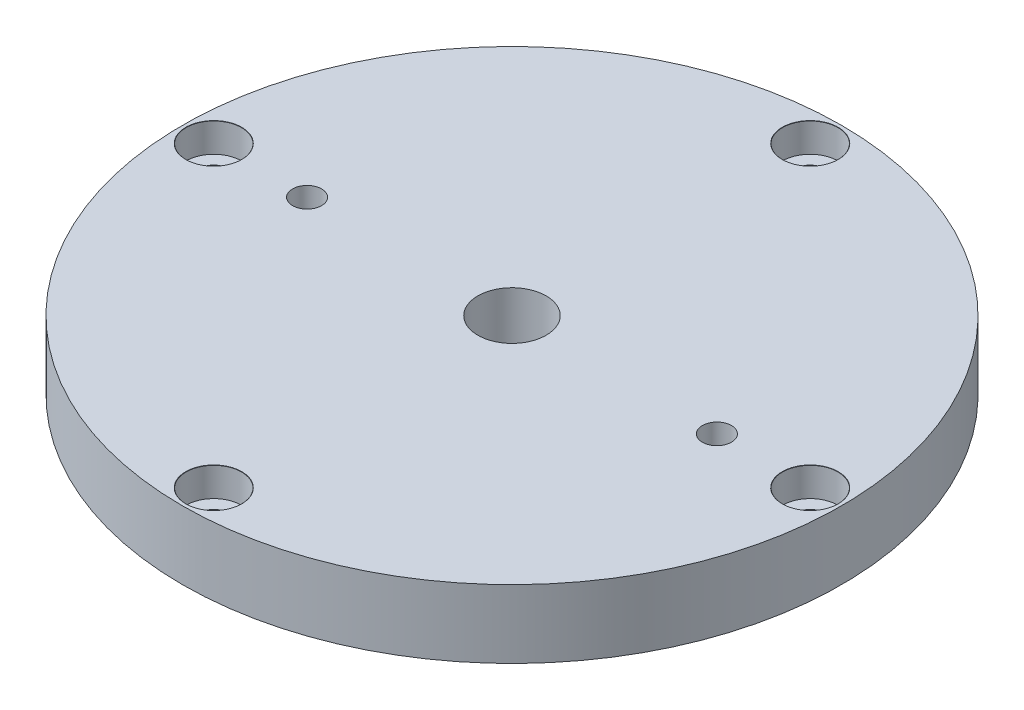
ISO-10303-21;
HEADER;
FILE_DESCRIPTION(('STEP AP214'),'2;1');
FILE_NAME('part.step','',(''),(''),'','','');
FILE_SCHEMA(('AUTOMOTIVE_DESIGN { 1 0 10303 214 1 1 1 1 }'));
ENDSEC;
DATA;
#1=APPLICATION_CONTEXT('core data for automotive mechanical design processes');
#2=APPLICATION_PROTOCOL_DEFINITION('international standard','automotive_design',2000,#1);
#3=PRODUCT_CONTEXT('',#1,'mechanical');
#4=PRODUCT('Part','Part','',(#3));
#5=PRODUCT_RELATED_PRODUCT_CATEGORY('part','',(#4));
#6=PRODUCT_DEFINITION_FORMATION('','',#4);
#7=PRODUCT_DEFINITION_CONTEXT('part definition',#1,'design');
#8=PRODUCT_DEFINITION('design','',#6,#7);
#9=PRODUCT_DEFINITION_SHAPE('','',#8);
#10=(LENGTH_UNIT() NAMED_UNIT(*) SI_UNIT(.MILLI.,.METRE.));
#11=(NAMED_UNIT(*) PLANE_ANGLE_UNIT() SI_UNIT($,.RADIAN.));
#12=(NAMED_UNIT(*) SI_UNIT($,.STERADIAN.) SOLID_ANGLE_UNIT());
#13=UNCERTAINTY_MEASURE_WITH_UNIT(LENGTH_MEASURE(1.E-05),#10,'distance_accuracy_value','');
#14=(GEOMETRIC_REPRESENTATION_CONTEXT(3) GLOBAL_UNCERTAINTY_ASSIGNED_CONTEXT((#13)) GLOBAL_UNIT_ASSIGNED_CONTEXT((#10,
#11,#12)) REPRESENTATION_CONTEXT('',''));
#15=CARTESIAN_POINT('',(0.,0.,0.));
#16=DIRECTION('',(0.,0.,1.));
#17=DIRECTION('',(1.,0.,0.));
#18=AXIS2_PLACEMENT_3D('',#15,#16,#17);
#19=CARTESIAN_POINT('',(0.,4.,0.));
#20=DIRECTION('',(0.,-1.,0.));
#21=DIRECTION('',(0.,0.,-1.));
#22=AXIS2_PLACEMENT_3D('',#19,#20,#21);
#23=CYLINDRICAL_SURFACE('',#22,38.6);
#24=CARTESIAN_POINT('',(0.,4.,0.));
#25=DIRECTION('',(0.,1.,0.));
#26=DIRECTION('',(0.,0.,1.));
#27=AXIS2_PLACEMENT_3D('',#24,#25,#26);
#28=CIRCLE('',#27,38.6);
#29=CARTESIAN_POINT('',(0.,4.,38.6));
#30=VERTEX_POINT('',#29);
#31=EDGE_CURVE('E11',#30,#30,#28,.T.);
#32=ORIENTED_EDGE('',*,*,#31,.F.);
#33=EDGE_LOOP('',(#32));
#34=FACE_BOUND('',#33,.T.);
#35=CARTESIAN_POINT('',(0.,-4.,0.));
#36=DIRECTION('',(0.,1.,0.));
#37=DIRECTION('',(0.,0.,1.));
#38=AXIS2_PLACEMENT_3D('',#35,#36,#37);
#39=CIRCLE('',#38,38.6);
#40=CARTESIAN_POINT('',(0.,-4.,38.6));
#41=VERTEX_POINT('',#40);
#42=EDGE_CURVE('E42',#41,#41,#39,.T.);
#43=ORIENTED_EDGE('',*,*,#42,.T.);
#44=EDGE_LOOP('',(#43));
#45=FACE_BOUND('',#44,.T.);
#46=ADVANCED_FACE('F39',(#34,#45),#23,.T.);
#47=CARTESIAN_POINT('',(0.,4.,0.));
#48=DIRECTION('',(0.,1.,0.));
#49=DIRECTION('',(0.,0.,1.));
#50=AXIS2_PLACEMENT_3D('',#47,#48,#49);
#51=PLANE('',#50);
#52=CARTESIAN_POINT('',(0.,4.,0.));
#53=DIRECTION('',(0.,-1.,0.));
#54=DIRECTION('',(0.,0.,-1.));
#55=AXIS2_PLACEMENT_3D('',#52,#53,#54);
#56=CIRCLE('',#55,4.);
#57=CARTESIAN_POINT('',(0.,4.,-4.));
#58=VERTEX_POINT('',#57);
#59=EDGE_CURVE('E202',#58,#58,#56,.T.);
#60=ORIENTED_EDGE('',*,*,#59,.T.);
#61=EDGE_LOOP('',(#60));
#62=FACE_BOUND('',#61,.T.);
#63=CARTESIAN_POINT('',(-24.,4.,0.));
#64=DIRECTION('',(0.,-1.,0.));
#65=DIRECTION('',(0.,0.,-1.));
#66=AXIS2_PLACEMENT_3D('',#63,#64,#65);
#67=CIRCLE('',#66,1.7);
#68=CARTESIAN_POINT('',(-24.,4.,-1.7));
#69=VERTEX_POINT('',#68);
#70=EDGE_CURVE('E208',#69,#69,#67,.T.);
#71=ORIENTED_EDGE('',*,*,#70,.T.);
#72=EDGE_LOOP('',(#71));
#73=FACE_BOUND('',#72,.T.);
#74=CARTESIAN_POINT('',(24.,4.,0.));
#75=DIRECTION('',(0.,-1.,0.));
#76=DIRECTION('',(0.,0.,1.));
#77=AXIS2_PLACEMENT_3D('',#74,#75,#76);
#78=CIRCLE('',#77,1.7);
#79=CARTESIAN_POINT('',(24.,4.,1.7));
#80=VERTEX_POINT('',#79);
#81=EDGE_CURVE('E205',#80,#80,#78,.T.);
#82=ORIENTED_EDGE('',*,*,#81,.T.);
#83=EDGE_LOOP('',(#82));
#84=FACE_BOUND('',#83,.T.);
#85=CARTESIAN_POINT('',(0.,4.,-34.93));
#86=DIRECTION('',(0.,1.,0.));
#87=DIRECTION('',(0.,0.,1.));
#88=AXIS2_PLACEMENT_3D('',#85,#86,#87);
#89=CIRCLE('',#88,3.275);
#90=CARTESIAN_POINT('',(0.,4.,-31.655));
#91=VERTEX_POINT('',#90);
#92=EDGE_CURVE('E211',#91,#91,#89,.T.);
#93=ORIENTED_EDGE('',*,*,#92,.F.);
#94=EDGE_LOOP('',(#93));
#95=FACE_BOUND('',#94,.T.);
#96=CARTESIAN_POINT('',(0.,4.,34.93));
#97=DIRECTION('',(0.,1.,0.));
#98=DIRECTION('',(0.,0.,1.));
#99=AXIS2_PLACEMENT_3D('',#96,#97,#98);
#100=CIRCLE('',#99,3.275);
#101=CARTESIAN_POINT('',(0.,4.,38.205));
#102=VERTEX_POINT('',#101);
#103=EDGE_CURVE('E234',#102,#102,#100,.T.);
#104=ORIENTED_EDGE('',*,*,#103,.F.);
#105=EDGE_LOOP('',(#104));
#106=FACE_BOUND('',#105,.T.);
#107=CARTESIAN_POINT('',(34.93,4.,0.));
#108=DIRECTION('',(0.,1.,0.));
#109=DIRECTION('',(0.,0.,1.));
#110=AXIS2_PLACEMENT_3D('',#107,#108,#109);
#111=CIRCLE('',#110,3.275);
#112=CARTESIAN_POINT('',(34.93,4.,3.275));
#113=VERTEX_POINT('',#112);
#114=EDGE_CURVE('E249',#113,#113,#111,.T.);
#115=ORIENTED_EDGE('',*,*,#114,.F.);
#116=EDGE_LOOP('',(#115));
#117=FACE_BOUND('',#116,.T.);
#118=CARTESIAN_POINT('',(-34.93,4.,0.));
#119=DIRECTION('',(0.,1.,0.));
#120=DIRECTION('',(0.,0.,1.));
#121=AXIS2_PLACEMENT_3D('',#118,#119,#120);
#122=CIRCLE('',#121,3.275);
#123=CARTESIAN_POINT('',(-34.93,4.,3.275));
#124=VERTEX_POINT('',#123);
#125=EDGE_CURVE('E264',#124,#124,#122,.T.);
#126=ORIENTED_EDGE('',*,*,#125,.F.);
#127=EDGE_LOOP('',(#126));
#128=FACE_BOUND('',#127,.T.);
#129=ORIENTED_EDGE('',*,*,#31,.T.);
#130=EDGE_LOOP('',(#129));
#131=FACE_BOUND('',#130,.T.);
#132=ADVANCED_FACE('F288',(#62,#73,#84,#95,#106,#117,#128,#131),#51,.T.);
#133=CARTESIAN_POINT('',(0.,-4.,0.));
#134=DIRECTION('',(0.,1.,0.));
#135=DIRECTION('',(0.,0.,1.));
#136=AXIS2_PLACEMENT_3D('',#133,#134,#135);
#137=PLANE('',#136);
#138=DIRECTION('',(0.,0.,1.));
#139=VECTOR('',#138,1.);
#140=CARTESIAN_POINT('',(-26.75,-4.,-1.58771324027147));
#141=LINE('',#140,#139);
#142=CARTESIAN_POINT('',(-26.75,-4.,-1.58771324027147));
#143=VERTEX_POINT('',#142);
#144=CARTESIAN_POINT('',(-26.75,-4.,1.58771324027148));
#145=VERTEX_POINT('',#144);
#146=EDGE_CURVE('E130',#143,#145,#141,.T.);
#147=ORIENTED_EDGE('',*,*,#146,.T.);
#148=DIRECTION('',(0.866025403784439,0.,0.5));
#149=VECTOR('',#148,1.);
#150=CARTESIAN_POINT('',(-26.75,-4.,1.58771324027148));
#151=LINE('',#150,#149);
#152=CARTESIAN_POINT('',(-24.,-4.,3.17542648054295));
#153=VERTEX_POINT('',#152);
#154=EDGE_CURVE('E154',#145,#153,#151,.T.);
#155=ORIENTED_EDGE('',*,*,#154,.T.);
#156=DIRECTION('',(0.866025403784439,0.,-0.5));
#157=VECTOR('',#156,1.);
#158=CARTESIAN_POINT('',(-24.,-4.,3.17542648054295));
#159=LINE('',#158,#157);
#160=CARTESIAN_POINT('',(-21.25,-4.,1.58771324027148));
#161=VERTEX_POINT('',#160);
#162=EDGE_CURVE('E782',#153,#161,#159,.T.);
#163=ORIENTED_EDGE('',*,*,#162,.T.);
#164=DIRECTION('',(0.,0.,-1.));
#165=VECTOR('',#164,1.);
#166=CARTESIAN_POINT('',(-21.25,-4.,1.58771324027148));
#167=LINE('',#166,#165);
#168=CARTESIAN_POINT('',(-21.25,-4.,-1.58771324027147));
#169=VERTEX_POINT('',#168);
#170=EDGE_CURVE('E784',#161,#169,#167,.T.);
#171=ORIENTED_EDGE('',*,*,#170,.T.);
#172=DIRECTION('',(-0.866025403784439,0.,-0.5));
#173=VECTOR('',#172,1.);
#174=CARTESIAN_POINT('',(-21.25,-4.,-1.58771324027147));
#175=LINE('',#174,#173);
#176=CARTESIAN_POINT('',(-24.,-4.,-3.17542648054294));
#177=VERTEX_POINT('',#176);
#178=EDGE_CURVE('E787',#169,#177,#175,.T.);
#179=ORIENTED_EDGE('',*,*,#178,.T.);
#180=DIRECTION('',(-0.866025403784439,0.,0.5));
#181=VECTOR('',#180,1.);
#182=CARTESIAN_POINT('',(-24.,-4.,-3.17542648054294));
#183=LINE('',#182,#181);
#184=EDGE_CURVE('E791',#177,#143,#183,.T.);
#185=ORIENTED_EDGE('',*,*,#184,.T.);
#186=EDGE_LOOP('',(#147,#155,#163,#171,#179,#185));
#187=FACE_BOUND('',#186,.T.);
#188=CARTESIAN_POINT('',(0.,-4.,0.));
#189=DIRECTION('',(0.,-1.,0.));
#190=DIRECTION('',(0.,0.,-1.));
#191=AXIS2_PLACEMENT_3D('',#188,#189,#190);
#192=CIRCLE('',#191,4.);
#193=CARTESIAN_POINT('',(0.,-4.,-4.));
#194=VERTEX_POINT('',#193);
#195=EDGE_CURVE('E196',#194,#194,#192,.T.);
#196=ORIENTED_EDGE('',*,*,#195,.F.);
#197=EDGE_LOOP('',(#196));
#198=FACE_BOUND('',#197,.T.);
#199=CARTESIAN_POINT('',(0.,-4.,-34.93));
#200=DIRECTION('',(0.,1.,0.));
#201=DIRECTION('',(0.,0.,1.));
#202=AXIS2_PLACEMENT_3D('',#199,#200,#201);
#203=CIRCLE('',#202,1.7);
#204=CARTESIAN_POINT('',(0.,-4.,-33.23));
#205=VERTEX_POINT('',#204);
#206=EDGE_CURVE('E231',#205,#205,#203,.T.);
#207=ORIENTED_EDGE('',*,*,#206,.T.);
#208=EDGE_LOOP('',(#207));
#209=FACE_BOUND('',#208,.T.);
#210=CARTESIAN_POINT('',(0.,-4.,34.93));
#211=DIRECTION('',(0.,1.,0.));
#212=DIRECTION('',(0.,0.,1.));
#213=AXIS2_PLACEMENT_3D('',#210,#211,#212);
#214=CIRCLE('',#213,1.7);
#215=CARTESIAN_POINT('',(0.,-4.,36.63));
#216=VERTEX_POINT('',#215);
#217=EDGE_CURVE('E246',#216,#216,#214,.T.);
#218=ORIENTED_EDGE('',*,*,#217,.T.);
#219=EDGE_LOOP('',(#218));
#220=FACE_BOUND('',#219,.T.);
#221=CARTESIAN_POINT('',(34.93,-4.,0.));
#222=DIRECTION('',(0.,1.,0.));
#223=DIRECTION('',(0.,0.,1.));
#224=AXIS2_PLACEMENT_3D('',#221,#222,#223);
#225=CIRCLE('',#224,1.7);
#226=CARTESIAN_POINT('',(34.93,-4.,1.7));
#227=VERTEX_POINT('',#226);
#228=EDGE_CURVE('E261',#227,#227,#225,.T.);
#229=ORIENTED_EDGE('',*,*,#228,.T.);
#230=EDGE_LOOP('',(#229));
#231=FACE_BOUND('',#230,.T.);
#232=CARTESIAN_POINT('',(-34.93,-4.,0.));
#233=DIRECTION('',(0.,1.,0.));
#234=DIRECTION('',(0.,0.,1.));
#235=AXIS2_PLACEMENT_3D('',#232,#233,#234);
#236=CIRCLE('',#235,1.7);
#237=CARTESIAN_POINT('',(-34.93,-4.,1.7));
#238=VERTEX_POINT('',#237);
#239=EDGE_CURVE('E276',#238,#238,#236,.T.);
#240=ORIENTED_EDGE('',*,*,#239,.T.);
#241=EDGE_LOOP('',(#240));
#242=FACE_BOUND('',#241,.T.);
#243=ORIENTED_EDGE('',*,*,#42,.F.);
#244=EDGE_LOOP('',(#243));
#245=FACE_BOUND('',#244,.T.);
#246=DIRECTION('',(0.866025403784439,0.,-0.5));
#247=VECTOR('',#246,1.);
#248=CARTESIAN_POINT('',(26.75,-4.,1.58771324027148));
#249=LINE('',#248,#247);
#250=CARTESIAN_POINT('',(24.,-4.,3.17542648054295));
#251=VERTEX_POINT('',#250);
#252=CARTESIAN_POINT('',(26.75,-4.,1.58771324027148));
#253=VERTEX_POINT('',#252);
#254=EDGE_CURVE('E176',#251,#253,#249,.T.);
#255=ORIENTED_EDGE('',*,*,#254,.T.);
#256=DIRECTION('',(0.,0.,-1.));
#257=VECTOR('',#256,1.);
#258=CARTESIAN_POINT('',(26.75,-4.,-1.58771324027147));
#259=LINE('',#258,#257);
#260=CARTESIAN_POINT('',(26.75,-4.,-1.58771324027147));
#261=VERTEX_POINT('',#260);
#262=EDGE_CURVE('E173',#253,#261,#259,.T.);
#263=ORIENTED_EDGE('',*,*,#262,.T.);
#264=DIRECTION('',(-0.866025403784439,0.,-0.5));
#265=VECTOR('',#264,1.);
#266=CARTESIAN_POINT('',(24.,-4.,-3.17542648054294));
#267=LINE('',#266,#265);
#268=CARTESIAN_POINT('',(24.,-4.,-3.17542648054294));
#269=VERTEX_POINT('',#268);
#270=EDGE_CURVE('E175',#261,#269,#267,.T.);
#271=ORIENTED_EDGE('',*,*,#270,.T.);
#272=DIRECTION('',(-0.866025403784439,0.,0.5));
#273=VECTOR('',#272,1.);
#274=CARTESIAN_POINT('',(21.25,-4.,-1.58771324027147));
#275=LINE('',#274,#273);
#276=CARTESIAN_POINT('',(21.25,-4.,-1.58771324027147));
#277=VERTEX_POINT('',#276);
#278=EDGE_CURVE('E199',#269,#277,#275,.T.);
#279=ORIENTED_EDGE('',*,*,#278,.T.);
#280=DIRECTION('',(0.,0.,1.));
#281=VECTOR('',#280,1.);
#282=CARTESIAN_POINT('',(21.25,-4.,1.58771324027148));
#283=LINE('',#282,#281);
#284=CARTESIAN_POINT('',(21.25,-4.,1.58771324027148));
#285=VERTEX_POINT('',#284);
#286=EDGE_CURVE('E197',#277,#285,#283,.T.);
#287=ORIENTED_EDGE('',*,*,#286,.T.);
#288=DIRECTION('',(0.866025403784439,0.,0.5));
#289=VECTOR('',#288,1.);
#290=CARTESIAN_POINT('',(24.,-4.,3.17542648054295));
#291=LINE('',#290,#289);
#292=EDGE_CURVE('E194',#285,#251,#291,.T.);
#293=ORIENTED_EDGE('',*,*,#292,.T.);
#294=EDGE_LOOP('',(#255,#263,#271,#279,#287,#293));
#295=FACE_BOUND('',#294,.T.);
#296=ADVANCED_FACE('F284',(#187,#198,#209,#220,#231,#242,#245,#295),#137,.F.);
#297=CARTESIAN_POINT('',(-34.93,4.,0.));
#298=DIRECTION('',(0.,1.,0.));
#299=DIRECTION('',(0.,0.,1.));
#300=AXIS2_PLACEMENT_3D('',#297,#298,#299);
#301=CYLINDRICAL_SURFACE('',#300,1.7);
#302=ORIENTED_EDGE('',*,*,#239,.F.);
#303=EDGE_LOOP('',(#302));
#304=FACE_BOUND('',#303,.T.);
#305=CARTESIAN_POINT('',(-34.93,0.6,0.));
#306=DIRECTION('',(0.,1.,0.));
#307=DIRECTION('',(0.,0.,1.));
#308=AXIS2_PLACEMENT_3D('',#305,#306,#307);
#309=CIRCLE('',#308,1.7);
#310=CARTESIAN_POINT('',(-34.93,0.6,1.7));
#311=VERTEX_POINT('',#310);
#312=EDGE_CURVE('E273',#311,#311,#309,.T.);
#313=ORIENTED_EDGE('',*,*,#312,.T.);
#314=EDGE_LOOP('',(#313));
#315=FACE_BOUND('',#314,.T.);
#316=ADVANCED_FACE('F287',(#304,#315),#301,.F.);
#317=CARTESIAN_POINT('',(-31.68,0.6,0.));
#318=DIRECTION('',(0.,-1.,0.));
#319=DIRECTION('',(0.,0.,-1.));
#320=AXIS2_PLACEMENT_3D('',#317,#318,#319);
#321=PLANE('',#320);
#322=ORIENTED_EDGE('',*,*,#312,.F.);
#323=EDGE_LOOP('',(#322));
#324=FACE_BOUND('',#323,.T.);
#325=CARTESIAN_POINT('',(-34.93,0.6,0.));
#326=DIRECTION('',(0.,1.,0.));
#327=DIRECTION('',(0.,0.,1.));
#328=AXIS2_PLACEMENT_3D('',#325,#326,#327);
#329=CIRCLE('',#328,3.25);
#330=CARTESIAN_POINT('',(-34.93,0.6,3.25));
#331=VERTEX_POINT('',#330);
#332=EDGE_CURVE('E270',#331,#331,#329,.T.);
#333=ORIENTED_EDGE('',*,*,#332,.T.);
#334=EDGE_LOOP('',(#333));
#335=FACE_BOUND('',#334,.T.);
#336=ADVANCED_FACE('F355',(#324,#335),#321,.F.);
#337=CARTESIAN_POINT('',(-34.93,4.,0.));
#338=DIRECTION('',(0.,1.,0.));
#339=DIRECTION('',(0.,0.,1.));
#340=AXIS2_PLACEMENT_3D('',#337,#338,#339);
#341=CYLINDRICAL_SURFACE('',#340,3.25);
#342=ORIENTED_EDGE('',*,*,#332,.F.);
#343=EDGE_LOOP('',(#342));
#344=FACE_BOUND('',#343,.T.);
#345=CARTESIAN_POINT('',(-34.93,3.975,0.));
#346=DIRECTION('',(0.,1.,0.));
#347=DIRECTION('',(0.,0.,1.));
#348=AXIS2_PLACEMENT_3D('',#345,#346,#347);
#349=CIRCLE('',#348,3.25);
#350=CARTESIAN_POINT('',(-34.93,3.975,3.25));
#351=VERTEX_POINT('',#350);
#352=EDGE_CURVE('E267',#351,#351,#349,.T.);
#353=ORIENTED_EDGE('',*,*,#352,.T.);
#354=EDGE_LOOP('',(#353));
#355=FACE_BOUND('',#354,.T.);
#356=ADVANCED_FACE('F359',(#344,#355),#341,.F.);
#357=CARTESIAN_POINT('',(-34.93,4.,0.));
#358=DIRECTION('',(0.,1.,0.));
#359=DIRECTION('',(0.,0.,1.));
#360=AXIS2_PLACEMENT_3D('',#357,#358,#359);
#361=CONICAL_SURFACE('',#360,3.275,0.785398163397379);
#362=ORIENTED_EDGE('',*,*,#352,.F.);
#363=EDGE_LOOP('',(#362));
#364=FACE_BOUND('',#363,.T.);
#365=ORIENTED_EDGE('',*,*,#125,.T.);
#366=EDGE_LOOP('',(#365));
#367=FACE_BOUND('',#366,.T.);
#368=ADVANCED_FACE('F363',(#364,#367),#361,.F.);
#369=CARTESIAN_POINT('',(34.93,4.,0.));
#370=DIRECTION('',(0.,1.,0.));
#371=DIRECTION('',(0.,0.,1.));
#372=AXIS2_PLACEMENT_3D('',#369,#370,#371);
#373=CYLINDRICAL_SURFACE('',#372,1.7);
#374=ORIENTED_EDGE('',*,*,#228,.F.);
#375=EDGE_LOOP('',(#374));
#376=FACE_BOUND('',#375,.T.);
#377=CARTESIAN_POINT('',(34.93,0.6,0.));
#378=DIRECTION('',(0.,1.,0.));
#379=DIRECTION('',(0.,0.,1.));
#380=AXIS2_PLACEMENT_3D('',#377,#378,#379);
#381=CIRCLE('',#380,1.7);
#382=CARTESIAN_POINT('',(34.93,0.6,1.7));
#383=VERTEX_POINT('',#382);
#384=EDGE_CURVE('E258',#383,#383,#381,.T.);
#385=ORIENTED_EDGE('',*,*,#384,.T.);
#386=EDGE_LOOP('',(#385));
#387=FACE_BOUND('',#386,.T.);
#388=ADVANCED_FACE('F367',(#376,#387),#373,.F.);
#389=CARTESIAN_POINT('',(38.18,0.6,0.));
#390=DIRECTION('',(0.,-1.,0.));
#391=DIRECTION('',(0.,0.,-1.));
#392=AXIS2_PLACEMENT_3D('',#389,#390,#391);
#393=PLANE('',#392);
#394=ORIENTED_EDGE('',*,*,#384,.F.);
#395=EDGE_LOOP('',(#394));
#396=FACE_BOUND('',#395,.T.);
#397=CARTESIAN_POINT('',(34.93,0.6,0.));
#398=DIRECTION('',(0.,1.,0.));
#399=DIRECTION('',(0.,0.,1.));
#400=AXIS2_PLACEMENT_3D('',#397,#398,#399);
#401=CIRCLE('',#400,3.25);
#402=CARTESIAN_POINT('',(34.93,0.6,3.25));
#403=VERTEX_POINT('',#402);
#404=EDGE_CURVE('E255',#403,#403,#401,.T.);
#405=ORIENTED_EDGE('',*,*,#404,.T.);
#406=EDGE_LOOP('',(#405));
#407=FACE_BOUND('',#406,.T.);
#408=ADVANCED_FACE('F371',(#396,#407),#393,.F.);
#409=CARTESIAN_POINT('',(34.93,4.,0.));
#410=DIRECTION('',(0.,1.,0.));
#411=DIRECTION('',(0.,0.,1.));
#412=AXIS2_PLACEMENT_3D('',#409,#410,#411);
#413=CYLINDRICAL_SURFACE('',#412,3.25);
#414=ORIENTED_EDGE('',*,*,#404,.F.);
#415=EDGE_LOOP('',(#414));
#416=FACE_BOUND('',#415,.T.);
#417=CARTESIAN_POINT('',(34.93,3.975,0.));
#418=DIRECTION('',(0.,1.,0.));
#419=DIRECTION('',(0.,0.,1.));
#420=AXIS2_PLACEMENT_3D('',#417,#418,#419);
#421=CIRCLE('',#420,3.25);
#422=CARTESIAN_POINT('',(34.93,3.975,3.25));
#423=VERTEX_POINT('',#422);
#424=EDGE_CURVE('E252',#423,#423,#421,.T.);
#425=ORIENTED_EDGE('',*,*,#424,.T.);
#426=EDGE_LOOP('',(#425));
#427=FACE_BOUND('',#426,.T.);
#428=ADVANCED_FACE('F375',(#416,#427),#413,.F.);
#429=CARTESIAN_POINT('',(34.93,4.,0.));
#430=DIRECTION('',(0.,1.,0.));
#431=DIRECTION('',(0.,0.,1.));
#432=AXIS2_PLACEMENT_3D('',#429,#430,#431);
#433=CONICAL_SURFACE('',#432,3.275,0.785398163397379);
#434=ORIENTED_EDGE('',*,*,#424,.F.);
#435=EDGE_LOOP('',(#434));
#436=FACE_BOUND('',#435,.T.);
#437=ORIENTED_EDGE('',*,*,#114,.T.);
#438=EDGE_LOOP('',(#437));
#439=FACE_BOUND('',#438,.T.);
#440=ADVANCED_FACE('F379',(#436,#439),#433,.F.);
#441=CARTESIAN_POINT('',(0.,4.,34.93));
#442=DIRECTION('',(0.,1.,0.));
#443=DIRECTION('',(0.,0.,1.));
#444=AXIS2_PLACEMENT_3D('',#441,#442,#443);
#445=CYLINDRICAL_SURFACE('',#444,1.7);
#446=ORIENTED_EDGE('',*,*,#217,.F.);
#447=EDGE_LOOP('',(#446));
#448=FACE_BOUND('',#447,.T.);
#449=CARTESIAN_POINT('',(0.,0.6,34.93));
#450=DIRECTION('',(0.,1.,0.));
#451=DIRECTION('',(0.,0.,1.));
#452=AXIS2_PLACEMENT_3D('',#449,#450,#451);
#453=CIRCLE('',#452,1.7);
#454=CARTESIAN_POINT('',(0.,0.6,36.63));
#455=VERTEX_POINT('',#454);
#456=EDGE_CURVE('E243',#455,#455,#453,.T.);
#457=ORIENTED_EDGE('',*,*,#456,.T.);
#458=EDGE_LOOP('',(#457));
#459=FACE_BOUND('',#458,.T.);
#460=ADVANCED_FACE('F383',(#448,#459),#445,.F.);
#461=CARTESIAN_POINT('',(3.25,0.6,34.93));
#462=DIRECTION('',(0.,-1.,0.));
#463=DIRECTION('',(0.,0.,-1.));
#464=AXIS2_PLACEMENT_3D('',#461,#462,#463);
#465=PLANE('',#464);
#466=ORIENTED_EDGE('',*,*,#456,.F.);
#467=EDGE_LOOP('',(#466));
#468=FACE_BOUND('',#467,.T.);
#469=CARTESIAN_POINT('',(0.,0.6,34.93));
#470=DIRECTION('',(0.,1.,0.));
#471=DIRECTION('',(0.,0.,1.));
#472=AXIS2_PLACEMENT_3D('',#469,#470,#471);
#473=CIRCLE('',#472,3.25);
#474=CARTESIAN_POINT('',(0.,0.6,38.18));
#475=VERTEX_POINT('',#474);
#476=EDGE_CURVE('E240',#475,#475,#473,.T.);
#477=ORIENTED_EDGE('',*,*,#476,.T.);
#478=EDGE_LOOP('',(#477));
#479=FACE_BOUND('',#478,.T.);
#480=ADVANCED_FACE('F387',(#468,#479),#465,.F.);
#481=CARTESIAN_POINT('',(0.,4.,34.93));
#482=DIRECTION('',(0.,1.,0.));
#483=DIRECTION('',(0.,0.,1.));
#484=AXIS2_PLACEMENT_3D('',#481,#482,#483);
#485=CYLINDRICAL_SURFACE('',#484,3.25);
#486=ORIENTED_EDGE('',*,*,#476,.F.);
#487=EDGE_LOOP('',(#486));
#488=FACE_BOUND('',#487,.T.);
#489=CARTESIAN_POINT('',(0.,3.975,34.93));
#490=DIRECTION('',(0.,1.,0.));
#491=DIRECTION('',(0.,0.,1.));
#492=AXIS2_PLACEMENT_3D('',#489,#490,#491);
#493=CIRCLE('',#492,3.25);
#494=CARTESIAN_POINT('',(0.,3.975,38.18));
#495=VERTEX_POINT('',#494);
#496=EDGE_CURVE('E237',#495,#495,#493,.T.);
#497=ORIENTED_EDGE('',*,*,#496,.T.);
#498=EDGE_LOOP('',(#497));
#499=FACE_BOUND('',#498,.T.);
#500=ADVANCED_FACE('F391',(#488,#499),#485,.F.);
#501=CARTESIAN_POINT('',(0.,4.,34.93));
#502=DIRECTION('',(0.,1.,0.));
#503=DIRECTION('',(0.,0.,1.));
#504=AXIS2_PLACEMENT_3D('',#501,#502,#503);
#505=CONICAL_SURFACE('',#504,3.275,0.78539816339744);
#506=ORIENTED_EDGE('',*,*,#496,.F.);
#507=EDGE_LOOP('',(#506));
#508=FACE_BOUND('',#507,.T.);
#509=ORIENTED_EDGE('',*,*,#103,.T.);
#510=EDGE_LOOP('',(#509));
#511=FACE_BOUND('',#510,.T.);
#512=ADVANCED_FACE('F395',(#508,#511),#505,.F.);
#513=CARTESIAN_POINT('',(0.,4.,-34.93));
#514=DIRECTION('',(0.,1.,0.));
#515=DIRECTION('',(0.,0.,1.));
#516=AXIS2_PLACEMENT_3D('',#513,#514,#515);
#517=CYLINDRICAL_SURFACE('',#516,1.7);
#518=ORIENTED_EDGE('',*,*,#206,.F.);
#519=EDGE_LOOP('',(#518));
#520=FACE_BOUND('',#519,.T.);
#521=CARTESIAN_POINT('',(0.,0.6,-34.93));
#522=DIRECTION('',(0.,1.,0.));
#523=DIRECTION('',(0.,0.,1.));
#524=AXIS2_PLACEMENT_3D('',#521,#522,#523);
#525=CIRCLE('',#524,1.7);
#526=CARTESIAN_POINT('',(0.,0.6,-33.23));
#527=VERTEX_POINT('',#526);
#528=EDGE_CURVE('E228',#527,#527,#525,.T.);
#529=ORIENTED_EDGE('',*,*,#528,.T.);
#530=EDGE_LOOP('',(#529));
#531=FACE_BOUND('',#530,.T.);
#532=ADVANCED_FACE('F399',(#520,#531),#517,.F.);
#533=CARTESIAN_POINT('',(3.25,0.6,-34.93));
#534=DIRECTION('',(0.,-1.,0.));
#535=DIRECTION('',(0.,0.,-1.));
#536=AXIS2_PLACEMENT_3D('',#533,#534,#535);
#537=PLANE('',#536);
#538=ORIENTED_EDGE('',*,*,#528,.F.);
#539=EDGE_LOOP('',(#538));
#540=FACE_BOUND('',#539,.T.);
#541=CARTESIAN_POINT('',(0.,0.6,-34.93));
#542=DIRECTION('',(0.,1.,0.));
#543=DIRECTION('',(0.,0.,1.));
#544=AXIS2_PLACEMENT_3D('',#541,#542,#543);
#545=CIRCLE('',#544,3.25);
#546=CARTESIAN_POINT('',(0.,0.6,-31.68));
#547=VERTEX_POINT('',#546);
#548=EDGE_CURVE('E225',#547,#547,#545,.T.);
#549=ORIENTED_EDGE('',*,*,#548,.T.);
#550=EDGE_LOOP('',(#549));
#551=FACE_BOUND('',#550,.T.);
#552=ADVANCED_FACE('F403',(#540,#551),#537,.F.);
#553=CARTESIAN_POINT('',(0.,4.,-34.93));
#554=DIRECTION('',(0.,1.,0.));
#555=DIRECTION('',(0.,0.,1.));
#556=AXIS2_PLACEMENT_3D('',#553,#554,#555);
#557=CYLINDRICAL_SURFACE('',#556,3.25);
#558=ORIENTED_EDGE('',*,*,#548,.F.);
#559=EDGE_LOOP('',(#558));
#560=FACE_BOUND('',#559,.T.);
#561=CARTESIAN_POINT('',(0.,3.975,-34.93));
#562=DIRECTION('',(0.,1.,0.));
#563=DIRECTION('',(0.,0.,1.));
#564=AXIS2_PLACEMENT_3D('',#561,#562,#563);
#565=CIRCLE('',#564,3.25);
#566=CARTESIAN_POINT('',(0.,3.975,-31.68));
#567=VERTEX_POINT('',#566);
#568=EDGE_CURVE('E222',#567,#567,#565,.T.);
#569=ORIENTED_EDGE('',*,*,#568,.T.);
#570=EDGE_LOOP('',(#569));
#571=FACE_BOUND('',#570,.T.);
#572=ADVANCED_FACE('F407',(#560,#571),#557,.F.);
#573=CARTESIAN_POINT('',(0.,4.,-34.93));
#574=DIRECTION('',(0.,1.,0.));
#575=DIRECTION('',(0.,0.,1.));
#576=AXIS2_PLACEMENT_3D('',#573,#574,#575);
#577=CONICAL_SURFACE('',#576,3.275,0.78539816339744);
#578=ORIENTED_EDGE('',*,*,#568,.F.);
#579=EDGE_LOOP('',(#578));
#580=FACE_BOUND('',#579,.T.);
#581=ORIENTED_EDGE('',*,*,#92,.T.);
#582=EDGE_LOOP('',(#581));
#583=FACE_BOUND('',#582,.T.);
#584=ADVANCED_FACE('F411',(#580,#583),#577,.F.);
#585=CARTESIAN_POINT('',(0.,-1.,0.));
#586=DIRECTION('',(0.,1.,0.));
#587=DIRECTION('',(0.,0.,1.));
#588=AXIS2_PLACEMENT_3D('',#585,#586,#587);
#589=PLANE('',#588);
#590=DIRECTION('',(-0.866025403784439,0.,-0.5));
#591=VECTOR('',#590,1.);
#592=CARTESIAN_POINT('',(-26.75,-1.,1.58771324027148));
#593=LINE('',#592,#591);
#594=CARTESIAN_POINT('',(-24.,-1.,3.17542648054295));
#595=VERTEX_POINT('',#594);
#596=CARTESIAN_POINT('',(-26.75,-1.,1.58771324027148));
#597=VERTEX_POINT('',#596);
#598=EDGE_CURVE('E150',#595,#597,#593,.T.);
#599=ORIENTED_EDGE('',*,*,#598,.T.);
#600=DIRECTION('',(0.,0.,-1.));
#601=VECTOR('',#600,1.);
#602=CARTESIAN_POINT('',(-26.75,-1.,-1.58771324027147));
#603=LINE('',#602,#601);
#604=CARTESIAN_POINT('',(-26.75,-1.,-1.58771324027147));
#605=VERTEX_POINT('',#604);
#606=EDGE_CURVE('E53',#597,#605,#603,.T.);
#607=ORIENTED_EDGE('',*,*,#606,.T.);
#608=DIRECTION('',(0.866025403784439,0.,-0.5));
#609=VECTOR('',#608,1.);
#610=CARTESIAN_POINT('',(-24.,-1.,-3.17542648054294));
#611=LINE('',#610,#609);
#612=CARTESIAN_POINT('',(-24.,-1.,-3.17542648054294));
#613=VERTEX_POINT('',#612);
#614=EDGE_CURVE('E137',#605,#613,#611,.T.);
#615=ORIENTED_EDGE('',*,*,#614,.T.);
#616=DIRECTION('',(0.866025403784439,0.,0.5));
#617=VECTOR('',#616,1.);
#618=CARTESIAN_POINT('',(-21.25,-1.,-1.58771324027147));
#619=LINE('',#618,#617);
#620=CARTESIAN_POINT('',(-21.25,-1.,-1.58771324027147));
#621=VERTEX_POINT('',#620);
#622=EDGE_CURVE('E143',#613,#621,#619,.T.);
#623=ORIENTED_EDGE('',*,*,#622,.T.);
#624=DIRECTION('',(0.,0.,1.));
#625=VECTOR('',#624,1.);
#626=CARTESIAN_POINT('',(-21.25,-1.,1.58771324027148));
#627=LINE('',#626,#625);
#628=CARTESIAN_POINT('',(-21.25,-1.,1.58771324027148));
#629=VERTEX_POINT('',#628);
#630=EDGE_CURVE('E157',#621,#629,#627,.T.);
#631=ORIENTED_EDGE('',*,*,#630,.T.);
#632=DIRECTION('',(-0.866025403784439,0.,0.5));
#633=VECTOR('',#632,1.);
#634=CARTESIAN_POINT('',(-24.,-1.,3.17542648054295));
#635=LINE('',#634,#633);
#636=EDGE_CURVE('E133',#629,#595,#635,.T.);
#637=ORIENTED_EDGE('',*,*,#636,.T.);
#638=EDGE_LOOP('',(#599,#607,#615,#623,#631,#637));
#639=FACE_BOUND('',#638,.T.);
#640=CARTESIAN_POINT('',(-24.,-1.,0.));
#641=DIRECTION('',(0.,-1.,0.));
#642=DIRECTION('',(0.,0.,-1.));
#643=AXIS2_PLACEMENT_3D('',#640,#641,#642);
#644=CIRCLE('',#643,1.7);
#645=CARTESIAN_POINT('',(-24.,-1.,-1.7));
#646=VERTEX_POINT('',#645);
#647=EDGE_CURVE('E212',#646,#646,#644,.T.);
#648=ORIENTED_EDGE('',*,*,#647,.F.);
#649=EDGE_LOOP('',(#648));
#650=FACE_BOUND('',#649,.T.);
#651=ADVANCED_FACE('F146',(#639,#650),#589,.F.);
#652=CARTESIAN_POINT('',(0.,-1.,0.));
#653=DIRECTION('',(0.,-1.,0.));
#654=DIRECTION('',(0.,0.,-1.));
#655=AXIS2_PLACEMENT_3D('',#652,#653,#654);
#656=PLANE('',#655);
#657=DIRECTION('',(-0.866025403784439,0.,0.5));
#658=VECTOR('',#657,1.);
#659=CARTESIAN_POINT('',(26.75,-1.,1.58771324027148));
#660=LINE('',#659,#658);
#661=CARTESIAN_POINT('',(26.75,-1.,1.58771324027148));
#662=VERTEX_POINT('',#661);
#663=CARTESIAN_POINT('',(24.,-1.,3.17542648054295));
#664=VERTEX_POINT('',#663);
#665=EDGE_CURVE('E61',#662,#664,#660,.T.);
#666=ORIENTED_EDGE('',*,*,#665,.T.);
#667=DIRECTION('',(-0.866025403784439,0.,-0.5));
#668=VECTOR('',#667,1.);
#669=CARTESIAN_POINT('',(24.,-1.,3.17542648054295));
#670=LINE('',#669,#668);
#671=CARTESIAN_POINT('',(21.25,-1.,1.58771324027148));
#672=VERTEX_POINT('',#671);
#673=EDGE_CURVE('E170',#664,#672,#670,.T.);
#674=ORIENTED_EDGE('',*,*,#673,.T.);
#675=DIRECTION('',(0.,0.,-1.));
#676=VECTOR('',#675,1.);
#677=CARTESIAN_POINT('',(21.25,-1.,1.58771324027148));
#678=LINE('',#677,#676);
#679=CARTESIAN_POINT('',(21.25,-1.,-1.58771324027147));
#680=VERTEX_POINT('',#679);
#681=EDGE_CURVE('E168',#672,#680,#678,.T.);
#682=ORIENTED_EDGE('',*,*,#681,.T.);
#683=DIRECTION('',(0.866025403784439,0.,-0.5));
#684=VECTOR('',#683,1.);
#685=CARTESIAN_POINT('',(21.25,-1.,-1.58771324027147));
#686=LINE('',#685,#684);
#687=CARTESIAN_POINT('',(24.,-1.,-3.17542648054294));
#688=VERTEX_POINT('',#687);
#689=EDGE_CURVE('E166',#680,#688,#686,.T.);
#690=ORIENTED_EDGE('',*,*,#689,.T.);
#691=DIRECTION('',(0.866025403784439,0.,0.5));
#692=VECTOR('',#691,1.);
#693=CARTESIAN_POINT('',(24.,-1.,-3.17542648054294));
#694=LINE('',#693,#692);
#695=CARTESIAN_POINT('',(26.75,-1.,-1.58771324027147));
#696=VERTEX_POINT('',#695);
#697=EDGE_CURVE('E164',#688,#696,#694,.T.);
#698=ORIENTED_EDGE('',*,*,#697,.T.);
#699=DIRECTION('',(0.,0.,1.));
#700=VECTOR('',#699,1.);
#701=CARTESIAN_POINT('',(26.75,-1.,-1.58771324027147));
#702=LINE('',#701,#700);
#703=EDGE_CURVE('E161',#696,#662,#702,.T.);
#704=ORIENTED_EDGE('',*,*,#703,.T.);
#705=EDGE_LOOP('',(#666,#674,#682,#690,#698,#704));
#706=FACE_BOUND('',#705,.T.);
#707=CARTESIAN_POINT('',(24.,-1.,0.));
#708=DIRECTION('',(0.,-1.,0.));
#709=DIRECTION('',(0.,0.,1.));
#710=AXIS2_PLACEMENT_3D('',#707,#708,#709);
#711=CIRCLE('',#710,1.7);
#712=CARTESIAN_POINT('',(24.,-1.,1.7));
#713=VERTEX_POINT('',#712);
#714=EDGE_CURVE('E215',#713,#713,#711,.T.);
#715=ORIENTED_EDGE('',*,*,#714,.F.);
#716=EDGE_LOOP('',(#715));
#717=FACE_BOUND('',#716,.T.);
#718=ADVANCED_FACE('F319',(#706,#717),#656,.T.);
#719=CARTESIAN_POINT('',(24.,4.,0.));
#720=DIRECTION('',(0.,-1.,0.));
#721=DIRECTION('',(0.,0.,-1.));
#722=AXIS2_PLACEMENT_3D('',#719,#720,#721);
#723=CYLINDRICAL_SURFACE('',#722,1.7);
#724=ORIENTED_EDGE('',*,*,#81,.F.);
#725=EDGE_LOOP('',(#724));
#726=FACE_BOUND('',#725,.T.);
#727=ORIENTED_EDGE('',*,*,#714,.T.);
#728=EDGE_LOOP('',(#727));
#729=FACE_BOUND('',#728,.T.);
#730=ADVANCED_FACE('F322',(#726,#729),#723,.F.);
#731=CARTESIAN_POINT('',(-24.,4.,0.));
#732=DIRECTION('',(0.,-1.,0.));
#733=DIRECTION('',(0.,0.,-1.));
#734=AXIS2_PLACEMENT_3D('',#731,#732,#733);
#735=CYLINDRICAL_SURFACE('',#734,1.7);
#736=ORIENTED_EDGE('',*,*,#70,.F.);
#737=EDGE_LOOP('',(#736));
#738=FACE_BOUND('',#737,.T.);
#739=ORIENTED_EDGE('',*,*,#647,.T.);
#740=EDGE_LOOP('',(#739));
#741=FACE_BOUND('',#740,.T.);
#742=ADVANCED_FACE('F327',(#738,#741),#735,.F.);
#743=CARTESIAN_POINT('',(0.,4.,0.));
#744=DIRECTION('',(0.,-1.,0.));
#745=DIRECTION('',(0.,0.,-1.));
#746=AXIS2_PLACEMENT_3D('',#743,#744,#745);
#747=CYLINDRICAL_SURFACE('',#746,4.);
#748=ORIENTED_EDGE('',*,*,#59,.F.);
#749=EDGE_LOOP('',(#748));
#750=FACE_BOUND('',#749,.T.);
#751=ORIENTED_EDGE('',*,*,#195,.T.);
#752=EDGE_LOOP('',(#751));
#753=FACE_BOUND('',#752,.T.);
#754=ADVANCED_FACE('F334',(#750,#753),#747,.F.);
#755=CARTESIAN_POINT('',(26.75,-16.2203403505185,1.58771324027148));
#756=DIRECTION('',(-0.5,0.,-0.866025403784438));
#757=DIRECTION('',(-0.866025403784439,0.,0.5));
#758=AXIS2_PLACEMENT_3D('',#755,#756,#757);
#759=PLANE('',#758);
#760=ORIENTED_EDGE('',*,*,#254,.F.);
#761=DIRECTION('',(0.,1.,0.));
#762=VECTOR('',#761,1.);
#763=CARTESIAN_POINT('',(24.,-16.2203403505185,3.17542648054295));
#764=LINE('',#763,#762);
#765=EDGE_CURVE('E163',#251,#664,#764,.T.);
#766=ORIENTED_EDGE('',*,*,#765,.T.);
#767=ORIENTED_EDGE('',*,*,#665,.F.);
#768=DIRECTION('',(0.,1.,0.));
#769=VECTOR('',#768,1.);
#770=CARTESIAN_POINT('',(26.75,-16.2203403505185,1.58771324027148));
#771=LINE('',#770,#769);
#772=EDGE_CURVE('E190',#253,#662,#771,.T.);
#773=ORIENTED_EDGE('',*,*,#772,.F.);
#774=EDGE_LOOP('',(#760,#766,#767,#773));
#775=FACE_BOUND('',#774,.T.);
#776=ADVANCED_FACE('F297',(#775),#759,.T.);
#777=CARTESIAN_POINT('',(24.,-16.2203403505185,3.17542648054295));
#778=DIRECTION('',(0.5,0.,-0.866025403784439));
#779=DIRECTION('',(-0.866025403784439,0.,-0.5));
#780=AXIS2_PLACEMENT_3D('',#777,#778,#779);
#781=PLANE('',#780);
#782=ORIENTED_EDGE('',*,*,#292,.F.);
#783=DIRECTION('',(0.,1.,0.));
#784=VECTOR('',#783,1.);
#785=CARTESIAN_POINT('',(21.25,-16.2203403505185,1.58771324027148));
#786=LINE('',#785,#784);
#787=EDGE_CURVE('E178',#285,#672,#786,.T.);
#788=ORIENTED_EDGE('',*,*,#787,.T.);
#789=ORIENTED_EDGE('',*,*,#673,.F.);
#790=ORIENTED_EDGE('',*,*,#765,.F.);
#791=EDGE_LOOP('',(#782,#788,#789,#790));
#792=FACE_BOUND('',#791,.T.);
#793=ADVANCED_FACE('F317',(#792),#781,.T.);
#794=CARTESIAN_POINT('',(21.25,-16.2203403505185,1.58771324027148));
#795=DIRECTION('',(1.,0.,0.));
#796=DIRECTION('',(0.,0.,-1.));
#797=AXIS2_PLACEMENT_3D('',#794,#795,#796);
#798=PLANE('',#797);
#799=ORIENTED_EDGE('',*,*,#286,.F.);
#800=DIRECTION('',(0.,1.,0.));
#801=VECTOR('',#800,1.);
#802=CARTESIAN_POINT('',(21.25,-16.2203403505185,-1.58771324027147));
#803=LINE('',#802,#801);
#804=EDGE_CURVE('E181',#277,#680,#803,.T.);
#805=ORIENTED_EDGE('',*,*,#804,.T.);
#806=ORIENTED_EDGE('',*,*,#681,.F.);
#807=ORIENTED_EDGE('',*,*,#787,.F.);
#808=EDGE_LOOP('',(#799,#805,#806,#807));
#809=FACE_BOUND('',#808,.T.);
#810=ADVANCED_FACE('F314',(#809),#798,.T.);
#811=CARTESIAN_POINT('',(21.25,-16.2203403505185,-1.58771324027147));
#812=DIRECTION('',(0.5,0.,0.866025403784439));
#813=DIRECTION('',(0.866025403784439,0.,-0.5));
#814=AXIS2_PLACEMENT_3D('',#811,#812,#813);
#815=PLANE('',#814);
#816=ORIENTED_EDGE('',*,*,#278,.F.);
#817=DIRECTION('',(0.,1.,0.));
#818=VECTOR('',#817,1.);
#819=CARTESIAN_POINT('',(24.,-16.2203403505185,-3.17542648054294));
#820=LINE('',#819,#818);
#821=EDGE_CURVE('E184',#269,#688,#820,.T.);
#822=ORIENTED_EDGE('',*,*,#821,.T.);
#823=ORIENTED_EDGE('',*,*,#689,.F.);
#824=ORIENTED_EDGE('',*,*,#804,.F.);
#825=EDGE_LOOP('',(#816,#822,#823,#824));
#826=FACE_BOUND('',#825,.T.);
#827=ADVANCED_FACE('F310',(#826),#815,.T.);
#828=CARTESIAN_POINT('',(24.,-16.2203403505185,-3.17542648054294));
#829=DIRECTION('',(-0.5,0.,0.866025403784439));
#830=DIRECTION('',(0.866025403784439,0.,0.5));
#831=AXIS2_PLACEMENT_3D('',#828,#829,#830);
#832=PLANE('',#831);
#833=ORIENTED_EDGE('',*,*,#270,.F.);
#834=DIRECTION('',(0.,1.,0.));
#835=VECTOR('',#834,1.);
#836=CARTESIAN_POINT('',(26.75,-16.2203403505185,-1.58771324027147));
#837=LINE('',#836,#835);
#838=EDGE_CURVE('E187',#261,#696,#837,.T.);
#839=ORIENTED_EDGE('',*,*,#838,.T.);
#840=ORIENTED_EDGE('',*,*,#697,.F.);
#841=ORIENTED_EDGE('',*,*,#821,.F.);
#842=EDGE_LOOP('',(#833,#839,#840,#841));
#843=FACE_BOUND('',#842,.T.);
#844=ADVANCED_FACE('F304',(#843),#832,.T.);
#845=CARTESIAN_POINT('',(26.75,-16.2203403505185,-1.58771324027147));
#846=DIRECTION('',(-1.,0.,0.));
#847=DIRECTION('',(0.,0.,1.));
#848=AXIS2_PLACEMENT_3D('',#845,#846,#847);
#849=PLANE('',#848);
#850=ORIENTED_EDGE('',*,*,#262,.F.);
#851=ORIENTED_EDGE('',*,*,#772,.T.);
#852=ORIENTED_EDGE('',*,*,#703,.F.);
#853=ORIENTED_EDGE('',*,*,#838,.F.);
#854=EDGE_LOOP('',(#850,#851,#852,#853));
#855=FACE_BOUND('',#854,.T.);
#856=ADVANCED_FACE('F301',(#855),#849,.T.);
#857=CARTESIAN_POINT('',(-26.75,-16.2203403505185,-1.58771324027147));
#858=DIRECTION('',(1.,0.,0.));
#859=DIRECTION('',(0.,0.,-1.));
#860=AXIS2_PLACEMENT_3D('',#857,#858,#859);
#861=PLANE('',#860);
#862=ORIENTED_EDGE('',*,*,#146,.F.);
#863=DIRECTION('',(0.,1.,0.));
#864=VECTOR('',#863,1.);
#865=CARTESIAN_POINT('',(-26.75,-16.2203403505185,-1.58771324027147));
#866=LINE('',#865,#864);
#867=EDGE_CURVE('E127',#143,#605,#866,.T.);
#868=ORIENTED_EDGE('',*,*,#867,.T.);
#869=ORIENTED_EDGE('',*,*,#606,.F.);
#870=DIRECTION('',(0.,1.,0.));
#871=VECTOR('',#870,1.);
#872=CARTESIAN_POINT('',(-26.75,-16.2203403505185,1.58771324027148));
#873=LINE('',#872,#871);
#874=EDGE_CURVE('E779',#145,#597,#873,.T.);
#875=ORIENTED_EDGE('',*,*,#874,.F.);
#876=EDGE_LOOP('',(#862,#868,#869,#875));
#877=FACE_BOUND('',#876,.T.);
#878=ADVANCED_FACE('F129',(#877),#861,.T.);
#879=CARTESIAN_POINT('',(-24.,-16.2203403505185,-3.17542648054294));
#880=DIRECTION('',(0.5,0.,0.866025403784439));
#881=DIRECTION('',(0.866025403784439,0.,-0.5));
#882=AXIS2_PLACEMENT_3D('',#879,#880,#881);
#883=PLANE('',#882);
#884=ORIENTED_EDGE('',*,*,#184,.F.);
#885=DIRECTION('',(0.,1.,0.));
#886=VECTOR('',#885,1.);
#887=CARTESIAN_POINT('',(-24.,-16.2203403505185,-3.17542648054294));
#888=LINE('',#887,#886);
#889=EDGE_CURVE('E134',#177,#613,#888,.T.);
#890=ORIENTED_EDGE('',*,*,#889,.T.);
#891=ORIENTED_EDGE('',*,*,#614,.F.);
#892=ORIENTED_EDGE('',*,*,#867,.F.);
#893=EDGE_LOOP('',(#884,#890,#891,#892));
#894=FACE_BOUND('',#893,.T.);
#895=ADVANCED_FACE('F138',(#894),#883,.T.);
#896=CARTESIAN_POINT('',(-21.25,-16.2203403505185,-1.58771324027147));
#897=DIRECTION('',(-0.5,0.,0.866025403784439));
#898=DIRECTION('',(0.866025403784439,0.,0.5));
#899=AXIS2_PLACEMENT_3D('',#896,#897,#898);
#900=PLANE('',#899);
#901=ORIENTED_EDGE('',*,*,#178,.F.);
#902=DIRECTION('',(0.,1.,0.));
#903=VECTOR('',#902,1.);
#904=CARTESIAN_POINT('',(-21.25,-16.2203403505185,-1.58771324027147));
#905=LINE('',#904,#903);
#906=EDGE_CURVE('E797',#169,#621,#905,.T.);
#907=ORIENTED_EDGE('',*,*,#906,.T.);
#908=ORIENTED_EDGE('',*,*,#622,.F.);
#909=ORIENTED_EDGE('',*,*,#889,.F.);
#910=EDGE_LOOP('',(#901,#907,#908,#909));
#911=FACE_BOUND('',#910,.T.);
#912=ADVANCED_FACE('F495',(#911),#900,.T.);
#913=CARTESIAN_POINT('',(-21.25,-16.2203403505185,1.58771324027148));
#914=DIRECTION('',(-1.,0.,0.));
#915=DIRECTION('',(0.,0.,1.));
#916=AXIS2_PLACEMENT_3D('',#913,#914,#915);
#917=PLANE('',#916);
#918=ORIENTED_EDGE('',*,*,#170,.F.);
#919=DIRECTION('',(0.,1.,0.));
#920=VECTOR('',#919,1.);
#921=CARTESIAN_POINT('',(-21.25,-16.2203403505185,1.58771324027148));
#922=LINE('',#921,#920);
#923=EDGE_CURVE('E795',#161,#629,#922,.T.);
#924=ORIENTED_EDGE('',*,*,#923,.T.);
#925=ORIENTED_EDGE('',*,*,#630,.F.);
#926=ORIENTED_EDGE('',*,*,#906,.F.);
#927=EDGE_LOOP('',(#918,#924,#925,#926));
#928=FACE_BOUND('',#927,.T.);
#929=ADVANCED_FACE('F505',(#928),#917,.T.);
#930=CARTESIAN_POINT('',(-24.,-16.2203403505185,3.17542648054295));
#931=DIRECTION('',(-0.5,0.,-0.866025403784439));
#932=DIRECTION('',(-0.866025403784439,0.,0.5));
#933=AXIS2_PLACEMENT_3D('',#930,#931,#932);
#934=PLANE('',#933);
#935=ORIENTED_EDGE('',*,*,#162,.F.);
#936=DIRECTION('',(0.,1.,0.));
#937=VECTOR('',#936,1.);
#938=CARTESIAN_POINT('',(-24.,-16.2203403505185,3.17542648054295));
#939=LINE('',#938,#937);
#940=EDGE_CURVE('E780',#153,#595,#939,.T.);
#941=ORIENTED_EDGE('',*,*,#940,.T.);
#942=ORIENTED_EDGE('',*,*,#636,.F.);
#943=ORIENTED_EDGE('',*,*,#923,.F.);
#944=EDGE_LOOP('',(#935,#941,#942,#943));
#945=FACE_BOUND('',#944,.T.);
#946=ADVANCED_FACE('F516',(#945),#934,.T.);
#947=CARTESIAN_POINT('',(-26.75,-16.2203403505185,1.58771324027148));
#948=DIRECTION('',(0.5,0.,-0.866025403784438));
#949=DIRECTION('',(-0.866025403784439,0.,-0.5));
#950=AXIS2_PLACEMENT_3D('',#947,#948,#949);
#951=PLANE('',#950);
#952=ORIENTED_EDGE('',*,*,#154,.F.);
#953=ORIENTED_EDGE('',*,*,#874,.T.);
#954=ORIENTED_EDGE('',*,*,#598,.F.);
#955=ORIENTED_EDGE('',*,*,#940,.F.);
#956=EDGE_LOOP('',(#952,#953,#954,#955));
#957=FACE_BOUND('',#956,.T.);
#958=ADVANCED_FACE('F527',(#957),#951,.T.);
#959=CLOSED_SHELL('',(#46,#132,#296,#316,#336,#356,#368,#388,#408,#428,#440,#460,#480,#500,#512,
#532,#552,#572,#584,#651,#718,#730,#742,#754,#776,#793,#810,#827,#844,#856,#878,#895,#912,#929,
#946,#958));
#960=MANIFOLD_SOLID_BREP('B2',#959);
#961=ADVANCED_BREP_SHAPE_REPRESENTATION('',(#18,#960),#14);
#962=SHAPE_DEFINITION_REPRESENTATION(#9,#961);
ENDSEC;
END-ISO-10303-21;
